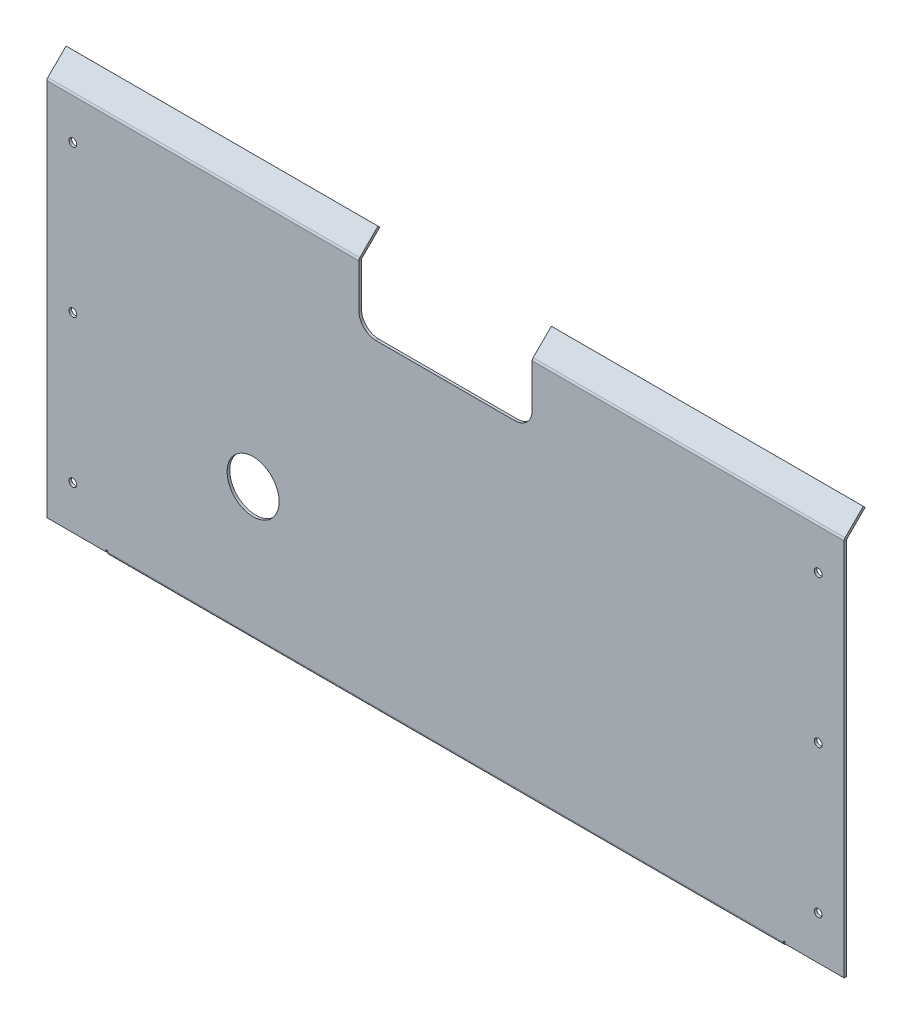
ISO-10303-21;
HEADER;
FILE_DESCRIPTION(('STEP AP214'),'2;1');
FILE_NAME('part.step','',(''),(''),'','','');
FILE_SCHEMA(('AUTOMOTIVE_DESIGN { 1 0 10303 214 1 1 1 1 }'));
ENDSEC;
DATA;
#1=APPLICATION_CONTEXT('core data for automotive mechanical design processes');
#2=APPLICATION_PROTOCOL_DEFINITION('international standard','automotive_design',2000,#1);
#3=PRODUCT_CONTEXT('',#1,'mechanical');
#4=PRODUCT('Part','Part','',(#3));
#5=PRODUCT_RELATED_PRODUCT_CATEGORY('part','',(#4));
#6=PRODUCT_DEFINITION_FORMATION('','',#4);
#7=PRODUCT_DEFINITION_CONTEXT('part definition',#1,'design');
#8=PRODUCT_DEFINITION('design','',#6,#7);
#9=PRODUCT_DEFINITION_SHAPE('','',#8);
#10=(LENGTH_UNIT() NAMED_UNIT(*) SI_UNIT(.MILLI.,.METRE.));
#11=(NAMED_UNIT(*) PLANE_ANGLE_UNIT() SI_UNIT($,.RADIAN.));
#12=(NAMED_UNIT(*) SI_UNIT($,.STERADIAN.) SOLID_ANGLE_UNIT());
#13=UNCERTAINTY_MEASURE_WITH_UNIT(LENGTH_MEASURE(1.E-05),#10,'distance_accuracy_value','');
#14=(GEOMETRIC_REPRESENTATION_CONTEXT(3) GLOBAL_UNCERTAINTY_ASSIGNED_CONTEXT((#13)) GLOBAL_UNIT_ASSIGNED_CONTEXT((#10,
#11,#12)) REPRESENTATION_CONTEXT('',''));
#15=CARTESIAN_POINT('',(0.,0.,0.));
#16=DIRECTION('',(0.,0.,1.));
#17=DIRECTION('',(1.,0.,0.));
#18=AXIS2_PLACEMENT_3D('',#15,#16,#17);
#19=CARTESIAN_POINT('',(80.,20.,3.));
#20=DIRECTION('',(0.,0.,1.));
#21=DIRECTION('',(1.,0.,0.));
#22=AXIS2_PLACEMENT_3D('',#19,#20,#21);
#23=PLANE('',#22);
#24=CARTESIAN_POINT('',(-222.,-217.,3.));
#25=DIRECTION('',(0.,0.,1.));
#26=DIRECTION('',(1.,0.,0.));
#27=AXIS2_PLACEMENT_3D('',#24,#25,#26);
#28=CIRCLE('',#27,30.);
#29=CARTESIAN_POINT('',(-192.,-217.,3.));
#30=VERTEX_POINT('',#29);
#31=EDGE_CURVE('E710',#30,#30,#28,.T.);
#32=ORIENTED_EDGE('',*,*,#31,.F.);
#33=EDGE_LOOP('',(#32));
#34=FACE_BOUND('',#33,.T.);
#35=CARTESIAN_POINT('',(-430.,-147.,3.));
#36=DIRECTION('',(0.,0.,1.));
#37=DIRECTION('',(1.,0.,0.));
#38=AXIS2_PLACEMENT_3D('',#35,#36,#37);
#39=CIRCLE('',#38,4.50000000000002);
#40=CARTESIAN_POINT('',(-425.5,-147.,3.));
#41=VERTEX_POINT('',#40);
#42=EDGE_CURVE('E726',#41,#41,#39,.F.);
#43=ORIENTED_EDGE('',*,*,#42,.T.);
#44=EDGE_LOOP('',(#43));
#45=FACE_BOUND('',#44,.T.);
#46=DIRECTION('',(1.,0.,0.));
#47=VECTOR('',#46,1.);
#48=CARTESIAN_POINT('',(-460.,-367.,3.));
#49=LINE('',#48,#47);
#50=CARTESIAN_POINT('',(-460.,-367.,3.));
#51=VERTEX_POINT('',#50);
#52=CARTESIAN_POINT('',(-391.5,-367.,3.));
#53=VERTEX_POINT('',#52);
#54=EDGE_CURVE('E474',#51,#53,#49,.T.);
#55=ORIENTED_EDGE('',*,*,#54,.T.);
#56=DIRECTION('',(0.,1.,0.));
#57=VECTOR('',#56,1.);
#58=CARTESIAN_POINT('',(-391.5,20.,3.));
#59=LINE('',#58,#57);
#60=CARTESIAN_POINT('',(-391.5,-364.7634,3.));
#61=VERTEX_POINT('',#60);
#62=EDGE_CURVE('E58',#53,#61,#59,.T.);
#63=ORIENTED_EDGE('',*,*,#62,.T.);
#64=DIRECTION('',(1.,0.,0.));
#65=VECTOR('',#64,1.);
#66=CARTESIAN_POINT('',(80.,-364.7634,3.));
#67=LINE('',#66,#65);
#68=CARTESIAN_POINT('',(-390.,-364.7634,3.));
#69=VERTEX_POINT('',#68);
#70=EDGE_CURVE('E62',#61,#69,#67,.T.);
#71=ORIENTED_EDGE('',*,*,#70,.T.);
#72=DIRECTION('',(0.,-1.,0.));
#73=VECTOR('',#72,1.);
#74=CARTESIAN_POINT('',(-390.,20.,3.));
#75=LINE('',#74,#73);
#76=CARTESIAN_POINT('',(-390.,-366.2634,3.));
#77=VERTEX_POINT('',#76);
#78=EDGE_CURVE('E341',#69,#77,#75,.T.);
#79=ORIENTED_EDGE('',*,*,#78,.T.);
#80=DIRECTION('',(-1.,0.,0.));
#81=VECTOR('',#80,1.);
#82=CARTESIAN_POINT('',(-390.,-366.2634,3.));
#83=LINE('',#82,#81);
#84=CARTESIAN_POINT('',(390.,-366.2634,3.));
#85=VERTEX_POINT('',#84);
#86=EDGE_CURVE('E284',#77,#85,#83,.F.);
#87=ORIENTED_EDGE('',*,*,#86,.T.);
#88=DIRECTION('',(0.,1.,0.));
#89=VECTOR('',#88,1.);
#90=CARTESIAN_POINT('',(390.,20.,3.));
#91=LINE('',#90,#89);
#92=CARTESIAN_POINT('',(390.,-364.7634,3.));
#93=VERTEX_POINT('',#92);
#94=EDGE_CURVE('E339',#85,#93,#91,.T.);
#95=ORIENTED_EDGE('',*,*,#94,.T.);
#96=DIRECTION('',(1.,0.,0.));
#97=VECTOR('',#96,1.);
#98=CARTESIAN_POINT('',(80.,-364.7634,3.));
#99=LINE('',#98,#97);
#100=CARTESIAN_POINT('',(391.5,-364.7634,3.));
#101=VERTEX_POINT('',#100);
#102=EDGE_CURVE('E337',#93,#101,#99,.T.);
#103=ORIENTED_EDGE('',*,*,#102,.T.);
#104=DIRECTION('',(0.,-1.,0.));
#105=VECTOR('',#104,1.);
#106=CARTESIAN_POINT('',(391.50000000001,19.9999999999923,3.));
#107=LINE('',#106,#105);
#108=CARTESIAN_POINT('',(391.5,-367.,3.));
#109=VERTEX_POINT('',#108);
#110=EDGE_CURVE('E302',#101,#109,#107,.T.);
#111=ORIENTED_EDGE('',*,*,#110,.T.);
#112=CARTESIAN_POINT('',(460.,-367.,3.));
#113=VERTEX_POINT('',#112);
#114=EDGE_CURVE('E473',#109,#113,#49,.T.);
#115=ORIENTED_EDGE('',*,*,#114,.T.);
#116=DIRECTION('',(0.,1.,0.));
#117=VECTOR('',#116,1.);
#118=CARTESIAN_POINT('',(460.,70.,3.));
#119=LINE('',#118,#117);
#120=CARTESIAN_POINT('',(460.,69.694890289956,3.00000000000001));
#121=VERTEX_POINT('',#120);
#122=EDGE_CURVE('E476',#113,#121,#119,.T.);
#123=ORIENTED_EDGE('',*,*,#122,.T.);
#124=DIRECTION('',(1.,0.,0.));
#125=VECTOR('',#124,1.);
#126=CARTESIAN_POINT('',(460.,69.694890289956,3.00000000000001));
#127=LINE('',#126,#125);
#128=CARTESIAN_POINT('',(100.,69.694890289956,3.));
#129=VERTEX_POINT('',#128);
#130=EDGE_CURVE('E384',#121,#129,#127,.F.);
#131=ORIENTED_EDGE('',*,*,#130,.T.);
#132=DIRECTION('',(0.,-1.,0.));
#133=VECTOR('',#132,1.);
#134=CARTESIAN_POINT('',(100.,20.0000000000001,3.));
#135=LINE('',#134,#133);
#136=CARTESIAN_POINT('',(100.,20.0000000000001,3.));
#137=VERTEX_POINT('',#136);
#138=EDGE_CURVE('E479',#129,#137,#135,.T.);
#139=ORIENTED_EDGE('',*,*,#138,.T.);
#140=CARTESIAN_POINT('',(80.,20.,3.));
#141=DIRECTION('',(0.,0.,-1.));
#142=DIRECTION('',(1.,0.,0.));
#143=AXIS2_PLACEMENT_3D('',#140,#141,#142);
#144=CIRCLE('',#143,20.);
#145=CARTESIAN_POINT('',(79.9999999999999,0.,3.));
#146=VERTEX_POINT('',#145);
#147=EDGE_CURVE('E481',#137,#146,#144,.T.);
#148=ORIENTED_EDGE('',*,*,#147,.T.);
#149=DIRECTION('',(-1.,0.,0.));
#150=VECTOR('',#149,1.);
#151=CARTESIAN_POINT('',(-79.9999999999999,0.,3.));
#152=LINE('',#151,#150);
#153=CARTESIAN_POINT('',(-79.9999999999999,0.,3.));
#154=VERTEX_POINT('',#153);
#155=EDGE_CURVE('E483',#146,#154,#152,.T.);
#156=ORIENTED_EDGE('',*,*,#155,.T.);
#157=CARTESIAN_POINT('',(-80.,20.,3.));
#158=DIRECTION('',(0.,0.,-1.));
#159=DIRECTION('',(1.,0.,0.));
#160=AXIS2_PLACEMENT_3D('',#157,#158,#159);
#161=CIRCLE('',#160,20.);
#162=CARTESIAN_POINT('',(-100.,20.0000000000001,3.));
#163=VERTEX_POINT('',#162);
#164=EDGE_CURVE('E485',#154,#163,#161,.T.);
#165=ORIENTED_EDGE('',*,*,#164,.T.);
#166=DIRECTION('',(0.,1.,0.));
#167=VECTOR('',#166,1.);
#168=CARTESIAN_POINT('',(-100.,70.,3.));
#169=LINE('',#168,#167);
#170=CARTESIAN_POINT('',(-100.,69.694890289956,3.00000000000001));
#171=VERTEX_POINT('',#170);
#172=EDGE_CURVE('E487',#163,#171,#169,.T.);
#173=ORIENTED_EDGE('',*,*,#172,.T.);
#174=DIRECTION('',(1.,0.,0.));
#175=VECTOR('',#174,1.);
#176=CARTESIAN_POINT('',(-99.9999999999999,69.694890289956,3.00000000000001));
#177=LINE('',#176,#175);
#178=CARTESIAN_POINT('',(-460.,69.694890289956,3.));
#179=VERTEX_POINT('',#178);
#180=EDGE_CURVE('E437',#171,#179,#177,.F.);
#181=ORIENTED_EDGE('',*,*,#180,.T.);
#182=DIRECTION('',(0.,-1.,0.));
#183=VECTOR('',#182,1.);
#184=CARTESIAN_POINT('',(-460.,70.,3.));
#185=LINE('',#184,#183);
#186=EDGE_CURVE('E471',#179,#51,#185,.T.);
#187=ORIENTED_EDGE('',*,*,#186,.T.);
#188=EDGE_LOOP('',(#55,#63,#71,#79,#87,#95,#103,#111,#115,#123,#131,#139,#148,#156,#165,#173,
#181,#187));
#189=FACE_BOUND('',#188,.T.);
#190=CARTESIAN_POINT('',(430.,23.,3.));
#191=DIRECTION('',(0.,0.,1.));
#192=DIRECTION('',(1.,0.,0.));
#193=AXIS2_PLACEMENT_3D('',#190,#191,#192);
#194=CIRCLE('',#193,4.50000000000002);
#195=CARTESIAN_POINT('',(434.5,23.,3.));
#196=VERTEX_POINT('',#195);
#197=EDGE_CURVE('E640',#196,#196,#194,.T.);
#198=ORIENTED_EDGE('',*,*,#197,.F.);
#199=EDGE_LOOP('',(#198));
#200=FACE_BOUND('',#199,.T.);
#201=CARTESIAN_POINT('',(430.,-147.,3.));
#202=DIRECTION('',(0.,0.,1.));
#203=DIRECTION('',(1.,0.,0.));
#204=AXIS2_PLACEMENT_3D('',#201,#202,#203);
#205=CIRCLE('',#204,4.50000000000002);
#206=CARTESIAN_POINT('',(434.5,-147.,3.));
#207=VERTEX_POINT('',#206);
#208=EDGE_CURVE('E744',#207,#207,#205,.T.);
#209=ORIENTED_EDGE('',*,*,#208,.F.);
#210=EDGE_LOOP('',(#209));
#211=FACE_BOUND('',#210,.T.);
#212=CARTESIAN_POINT('',(430.,-317.,3.));
#213=DIRECTION('',(0.,0.,1.));
#214=DIRECTION('',(1.,0.,0.));
#215=AXIS2_PLACEMENT_3D('',#212,#213,#214);
#216=CIRCLE('',#215,4.50000000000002);
#217=CARTESIAN_POINT('',(434.5,-317.,3.));
#218=VERTEX_POINT('',#217);
#219=EDGE_CURVE('E738',#218,#218,#216,.T.);
#220=ORIENTED_EDGE('',*,*,#219,.F.);
#221=EDGE_LOOP('',(#220));
#222=FACE_BOUND('',#221,.T.);
#223=CARTESIAN_POINT('',(-430.,23.,3.));
#224=DIRECTION('',(0.,0.,1.));
#225=DIRECTION('',(1.,0.,0.));
#226=AXIS2_PLACEMENT_3D('',#223,#224,#225);
#227=CIRCLE('',#226,4.50000000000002);
#228=CARTESIAN_POINT('',(-425.5,23.,3.));
#229=VERTEX_POINT('',#228);
#230=EDGE_CURVE('E732',#229,#229,#227,.F.);
#231=ORIENTED_EDGE('',*,*,#230,.T.);
#232=EDGE_LOOP('',(#231));
#233=FACE_BOUND('',#232,.T.);
#234=CARTESIAN_POINT('',(-430.,-317.,3.));
#235=DIRECTION('',(0.,0.,1.));
#236=DIRECTION('',(1.,0.,0.));
#237=AXIS2_PLACEMENT_3D('',#234,#235,#236);
#238=CIRCLE('',#237,4.50000000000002);
#239=CARTESIAN_POINT('',(-425.5,-317.,3.));
#240=VERTEX_POINT('',#239);
#241=EDGE_CURVE('E720',#240,#240,#238,.F.);
#242=ORIENTED_EDGE('',*,*,#241,.T.);
#243=EDGE_LOOP('',(#242));
#244=FACE_BOUND('',#243,.T.);
#245=ADVANCED_FACE('F43',(#34,#45,#189,#200,#211,#222,#233,#244),#23,.T.);
#246=CARTESIAN_POINT('',(80.,20.,0.));
#247=DIRECTION('',(0.,0.,1.));
#248=DIRECTION('',(1.,0.,0.));
#249=AXIS2_PLACEMENT_3D('',#246,#247,#248);
#250=PLANE('',#249);
#251=CARTESIAN_POINT('',(-222.,-217.,0.));
#252=DIRECTION('',(0.,0.,-1.));
#253=DIRECTION('',(-1.,0.,0.));
#254=AXIS2_PLACEMENT_3D('',#251,#252,#253);
#255=CIRCLE('',#254,30.);
#256=CARTESIAN_POINT('',(-252.,-217.,0.));
#257=VERTEX_POINT('',#256);
#258=EDGE_CURVE('E713',#257,#257,#255,.T.);
#259=ORIENTED_EDGE('',*,*,#258,.F.);
#260=EDGE_LOOP('',(#259));
#261=FACE_BOUND('',#260,.T.);
#262=CARTESIAN_POINT('',(-430.,-147.,0.));
#263=DIRECTION('',(0.,0.,1.));
#264=DIRECTION('',(1.,0.,0.));
#265=AXIS2_PLACEMENT_3D('',#262,#263,#264);
#266=CIRCLE('',#265,4.50000000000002);
#267=CARTESIAN_POINT('',(-425.5,-147.,0.));
#268=VERTEX_POINT('',#267);
#269=EDGE_CURVE('E723',#268,#268,#266,.T.);
#270=ORIENTED_EDGE('',*,*,#269,.T.);
#271=EDGE_LOOP('',(#270));
#272=FACE_BOUND('',#271,.T.);
#273=DIRECTION('',(0.,1.,0.));
#274=VECTOR('',#273,1.);
#275=CARTESIAN_POINT('',(-391.5,-367.,0.));
#276=LINE('',#275,#274);
#277=CARTESIAN_POINT('',(-391.5,-367.,0.));
#278=VERTEX_POINT('',#277);
#279=CARTESIAN_POINT('',(-391.5,-364.7634,0.));
#280=VERTEX_POINT('',#279);
#281=EDGE_CURVE('E299',#278,#280,#276,.T.);
#282=ORIENTED_EDGE('',*,*,#281,.F.);
#283=DIRECTION('',(1.,0.,0.));
#284=VECTOR('',#283,1.);
#285=CARTESIAN_POINT('',(-460.,-367.,0.));
#286=LINE('',#285,#284);
#287=CARTESIAN_POINT('',(-460.,-367.,0.));
#288=VERTEX_POINT('',#287);
#289=EDGE_CURVE('E454',#288,#278,#286,.T.);
#290=ORIENTED_EDGE('',*,*,#289,.F.);
#291=DIRECTION('',(0.,-1.,0.));
#292=VECTOR('',#291,1.);
#293=CARTESIAN_POINT('',(-460.,70.,0.));
#294=LINE('',#293,#292);
#295=CARTESIAN_POINT('',(-460.,69.694890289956,0.));
#296=VERTEX_POINT('',#295);
#297=EDGE_CURVE('E449',#296,#288,#294,.T.);
#298=ORIENTED_EDGE('',*,*,#297,.F.);
#299=DIRECTION('',(1.,0.,0.));
#300=VECTOR('',#299,1.);
#301=CARTESIAN_POINT('',(-99.9999999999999,69.694890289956,0.));
#302=LINE('',#301,#300);
#303=CARTESIAN_POINT('',(-100.,69.694890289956,0.));
#304=VERTEX_POINT('',#303);
#305=EDGE_CURVE('E433',#304,#296,#302,.F.);
#306=ORIENTED_EDGE('',*,*,#305,.F.);
#307=DIRECTION('',(0.,1.,0.));
#308=VECTOR('',#307,1.);
#309=CARTESIAN_POINT('',(-100.,70.,0.));
#310=LINE('',#309,#308);
#311=CARTESIAN_POINT('',(-100.,20.0000000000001,0.));
#312=VERTEX_POINT('',#311);
#313=EDGE_CURVE('E468',#312,#304,#310,.T.);
#314=ORIENTED_EDGE('',*,*,#313,.F.);
#315=CARTESIAN_POINT('',(-80.,20.,0.));
#316=DIRECTION('',(0.,0.,-1.));
#317=DIRECTION('',(1.,0.,0.));
#318=AXIS2_PLACEMENT_3D('',#315,#316,#317);
#319=CIRCLE('',#318,20.);
#320=CARTESIAN_POINT('',(-79.9999999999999,0.,0.));
#321=VERTEX_POINT('',#320);
#322=EDGE_CURVE('E466',#321,#312,#319,.T.);
#323=ORIENTED_EDGE('',*,*,#322,.F.);
#324=DIRECTION('',(-1.,0.,0.));
#325=VECTOR('',#324,1.);
#326=CARTESIAN_POINT('',(-79.9999999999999,0.,0.));
#327=LINE('',#326,#325);
#328=CARTESIAN_POINT('',(79.9999999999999,0.,0.));
#329=VERTEX_POINT('',#328);
#330=EDGE_CURVE('E464',#329,#321,#327,.T.);
#331=ORIENTED_EDGE('',*,*,#330,.F.);
#332=CARTESIAN_POINT('',(80.,20.,0.));
#333=DIRECTION('',(0.,0.,-1.));
#334=DIRECTION('',(1.,0.,0.));
#335=AXIS2_PLACEMENT_3D('',#332,#333,#334);
#336=CIRCLE('',#335,20.);
#337=CARTESIAN_POINT('',(100.,20.0000000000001,0.));
#338=VERTEX_POINT('',#337);
#339=EDGE_CURVE('E462',#338,#329,#336,.T.);
#340=ORIENTED_EDGE('',*,*,#339,.F.);
#341=DIRECTION('',(0.,-1.,0.));
#342=VECTOR('',#341,1.);
#343=CARTESIAN_POINT('',(100.,20.0000000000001,0.));
#344=LINE('',#343,#342);
#345=CARTESIAN_POINT('',(100.,69.694890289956,0.));
#346=VERTEX_POINT('',#345);
#347=EDGE_CURVE('E460',#346,#338,#344,.T.);
#348=ORIENTED_EDGE('',*,*,#347,.F.);
#349=DIRECTION('',(1.,0.,0.));
#350=VECTOR('',#349,1.);
#351=CARTESIAN_POINT('',(460.,69.694890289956,0.));
#352=LINE('',#351,#350);
#353=CARTESIAN_POINT('',(460.,69.694890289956,0.));
#354=VERTEX_POINT('',#353);
#355=EDGE_CURVE('E380',#354,#346,#352,.F.);
#356=ORIENTED_EDGE('',*,*,#355,.F.);
#357=DIRECTION('',(0.,1.,0.));
#358=VECTOR('',#357,1.);
#359=CARTESIAN_POINT('',(460.,70.,0.));
#360=LINE('',#359,#358);
#361=CARTESIAN_POINT('',(460.,-367.,0.));
#362=VERTEX_POINT('',#361);
#363=EDGE_CURVE('E457',#362,#354,#360,.T.);
#364=ORIENTED_EDGE('',*,*,#363,.F.);
#365=CARTESIAN_POINT('',(391.5,-367.,0.));
#366=VERTEX_POINT('',#365);
#367=EDGE_CURVE('E453',#366,#362,#286,.T.);
#368=ORIENTED_EDGE('',*,*,#367,.F.);
#369=DIRECTION('',(0.,-1.,0.));
#370=VECTOR('',#369,1.);
#371=CARTESIAN_POINT('',(391.5,-364.7634,0.));
#372=LINE('',#371,#370);
#373=CARTESIAN_POINT('',(391.5,-364.7634,0.));
#374=VERTEX_POINT('',#373);
#375=EDGE_CURVE('E319',#374,#366,#372,.T.);
#376=ORIENTED_EDGE('',*,*,#375,.F.);
#377=DIRECTION('',(1.,0.,0.));
#378=VECTOR('',#377,1.);
#379=CARTESIAN_POINT('',(390.,-364.7634,0.));
#380=LINE('',#379,#378);
#381=CARTESIAN_POINT('',(390.,-364.7634,0.));
#382=VERTEX_POINT('',#381);
#383=EDGE_CURVE('E315',#382,#374,#380,.T.);
#384=ORIENTED_EDGE('',*,*,#383,.F.);
#385=DIRECTION('',(0.,1.,0.));
#386=VECTOR('',#385,1.);
#387=CARTESIAN_POINT('',(390.,-366.2634,0.));
#388=LINE('',#387,#386);
#389=CARTESIAN_POINT('',(390.,-366.2634,0.));
#390=VERTEX_POINT('',#389);
#391=EDGE_CURVE('E312',#390,#382,#388,.T.);
#392=ORIENTED_EDGE('',*,*,#391,.F.);
#393=DIRECTION('',(-1.,0.,0.));
#394=VECTOR('',#393,1.);
#395=CARTESIAN_POINT('',(-390.,-366.2634,0.));
#396=LINE('',#395,#394);
#397=CARTESIAN_POINT('',(-390.,-366.2634,0.));
#398=VERTEX_POINT('',#397);
#399=EDGE_CURVE('E280',#398,#390,#396,.F.);
#400=ORIENTED_EDGE('',*,*,#399,.F.);
#401=DIRECTION('',(0.,-1.,0.));
#402=VECTOR('',#401,1.);
#403=CARTESIAN_POINT('',(-390.,-364.7634,0.));
#404=LINE('',#403,#402);
#405=CARTESIAN_POINT('',(-390.,-364.7634,0.));
#406=VERTEX_POINT('',#405);
#407=EDGE_CURVE('E308',#406,#398,#404,.T.);
#408=ORIENTED_EDGE('',*,*,#407,.F.);
#409=DIRECTION('',(1.,0.,0.));
#410=VECTOR('',#409,1.);
#411=CARTESIAN_POINT('',(-391.5,-364.7634,0.));
#412=LINE('',#411,#410);
#413=EDGE_CURVE('E304',#280,#406,#412,.T.);
#414=ORIENTED_EDGE('',*,*,#413,.F.);
#415=EDGE_LOOP('',(#282,#290,#298,#306,#314,#323,#331,#340,#348,#356,#364,#368,#376,#384,#392,
#400,#408,#414));
#416=FACE_BOUND('',#415,.T.);
#417=CARTESIAN_POINT('',(430.,23.,0.));
#418=DIRECTION('',(0.,0.,-1.));
#419=DIRECTION('',(-1.,0.,0.));
#420=AXIS2_PLACEMENT_3D('',#417,#418,#419);
#421=CIRCLE('',#420,4.50000000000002);
#422=CARTESIAN_POINT('',(425.5,23.,0.));
#423=VERTEX_POINT('',#422);
#424=EDGE_CURVE('E644',#423,#423,#421,.T.);
#425=ORIENTED_EDGE('',*,*,#424,.F.);
#426=EDGE_LOOP('',(#425));
#427=FACE_BOUND('',#426,.T.);
#428=CARTESIAN_POINT('',(430.,-147.,0.));
#429=DIRECTION('',(0.,0.,-1.));
#430=DIRECTION('',(-1.,0.,0.));
#431=AXIS2_PLACEMENT_3D('',#428,#429,#430);
#432=CIRCLE('',#431,4.50000000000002);
#433=CARTESIAN_POINT('',(425.5,-147.,0.));
#434=VERTEX_POINT('',#433);
#435=EDGE_CURVE('E741',#434,#434,#432,.T.);
#436=ORIENTED_EDGE('',*,*,#435,.F.);
#437=EDGE_LOOP('',(#436));
#438=FACE_BOUND('',#437,.T.);
#439=CARTESIAN_POINT('',(430.,-317.,0.));
#440=DIRECTION('',(0.,0.,-1.));
#441=DIRECTION('',(-1.,0.,0.));
#442=AXIS2_PLACEMENT_3D('',#439,#440,#441);
#443=CIRCLE('',#442,4.50000000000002);
#444=CARTESIAN_POINT('',(425.5,-317.,0.));
#445=VERTEX_POINT('',#444);
#446=EDGE_CURVE('E735',#445,#445,#443,.T.);
#447=ORIENTED_EDGE('',*,*,#446,.F.);
#448=EDGE_LOOP('',(#447));
#449=FACE_BOUND('',#448,.T.);
#450=CARTESIAN_POINT('',(-430.,23.,0.));
#451=DIRECTION('',(0.,0.,1.));
#452=DIRECTION('',(1.,0.,0.));
#453=AXIS2_PLACEMENT_3D('',#450,#451,#452);
#454=CIRCLE('',#453,4.50000000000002);
#455=CARTESIAN_POINT('',(-425.5,23.,0.));
#456=VERTEX_POINT('',#455);
#457=EDGE_CURVE('E729',#456,#456,#454,.T.);
#458=ORIENTED_EDGE('',*,*,#457,.T.);
#459=EDGE_LOOP('',(#458));
#460=FACE_BOUND('',#459,.T.);
#461=CARTESIAN_POINT('',(-430.,-317.,0.));
#462=DIRECTION('',(0.,0.,1.));
#463=DIRECTION('',(1.,0.,0.));
#464=AXIS2_PLACEMENT_3D('',#461,#462,#463);
#465=CIRCLE('',#464,4.50000000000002);
#466=CARTESIAN_POINT('',(-425.5,-317.,0.));
#467=VERTEX_POINT('',#466);
#468=EDGE_CURVE('E715',#467,#467,#465,.T.);
#469=ORIENTED_EDGE('',*,*,#468,.T.);
#470=EDGE_LOOP('',(#469));
#471=FACE_BOUND('',#470,.T.);
#472=ADVANCED_FACE('F511',(#261,#272,#416,#427,#438,#449,#460,#471),#250,.F.);
#473=CARTESIAN_POINT('',(-460.,-367.,3.));
#474=DIRECTION('',(0.,1.,0.));
#475=DIRECTION('',(0.,0.,1.));
#476=AXIS2_PLACEMENT_3D('',#473,#474,#475);
#477=PLANE('',#476);
#478=DIRECTION('',(0.,0.,1.));
#479=VECTOR('',#478,1.);
#480=CARTESIAN_POINT('',(-391.5,-367.,0.));
#481=LINE('',#480,#479);
#482=EDGE_CURVE('E303',#278,#53,#481,.T.);
#483=ORIENTED_EDGE('',*,*,#482,.T.);
#484=ORIENTED_EDGE('',*,*,#54,.F.);
#485=DIRECTION('',(0.,0.,-1.));
#486=VECTOR('',#485,1.);
#487=CARTESIAN_POINT('',(-460.,-367.,3.));
#488=LINE('',#487,#486);
#489=EDGE_CURVE('E11',#51,#288,#488,.T.);
#490=ORIENTED_EDGE('',*,*,#489,.T.);
#491=ORIENTED_EDGE('',*,*,#289,.T.);
#492=EDGE_LOOP('',(#483,#484,#490,#491));
#493=FACE_BOUND('',#492,.T.);
#494=ADVANCED_FACE('F570',(#493),#477,.F.);
#495=DIRECTION('',(0.,0.,1.));
#496=VECTOR('',#495,1.);
#497=CARTESIAN_POINT('',(391.5,-367.,0.));
#498=LINE('',#497,#496);
#499=EDGE_CURVE('E322',#366,#109,#498,.T.);
#500=ORIENTED_EDGE('',*,*,#499,.F.);
#501=ORIENTED_EDGE('',*,*,#367,.T.);
#502=DIRECTION('',(0.,0.,-1.));
#503=VECTOR('',#502,1.);
#504=CARTESIAN_POINT('',(460.,-367.,3.));
#505=LINE('',#504,#503);
#506=EDGE_CURVE('E51',#113,#362,#505,.T.);
#507=ORIENTED_EDGE('',*,*,#506,.F.);
#508=ORIENTED_EDGE('',*,*,#114,.F.);
#509=EDGE_LOOP('',(#500,#501,#507,#508));
#510=FACE_BOUND('',#509,.T.);
#511=ADVANCED_FACE('F597',(#510),#477,.F.);
#512=CARTESIAN_POINT('',(460.,70.,3.));
#513=DIRECTION('',(-1.,0.,0.));
#514=DIRECTION('',(0.,-1.,0.));
#515=AXIS2_PLACEMENT_3D('',#512,#513,#514);
#516=PLANE('',#515);
#517=DIRECTION('',(0.,0.,1.));
#518=VECTOR('',#517,1.);
#519=CARTESIAN_POINT('',(460.,69.694890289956,0.));
#520=LINE('',#519,#518);
#521=EDGE_CURVE('E390',#354,#121,#520,.T.);
#522=ORIENTED_EDGE('',*,*,#521,.T.);
#523=ORIENTED_EDGE('',*,*,#122,.F.);
#524=ORIENTED_EDGE('',*,*,#506,.T.);
#525=ORIENTED_EDGE('',*,*,#363,.T.);
#526=EDGE_LOOP('',(#522,#523,#524,#525));
#527=FACE_BOUND('',#526,.T.);
#528=ADVANCED_FACE('F506',(#527),#516,.F.);
#529=CARTESIAN_POINT('',(100.,20.0000000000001,3.));
#530=DIRECTION('',(1.,0.,0.));
#531=DIRECTION('',(0.,0.,-1.));
#532=AXIS2_PLACEMENT_3D('',#529,#530,#531);
#533=PLANE('',#532);
#534=DIRECTION('',(0.,0.,1.));
#535=VECTOR('',#534,1.);
#536=CARTESIAN_POINT('',(100.,69.694890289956,0.));
#537=LINE('',#536,#535);
#538=EDGE_CURVE('E393',#346,#129,#537,.T.);
#539=ORIENTED_EDGE('',*,*,#538,.F.);
#540=ORIENTED_EDGE('',*,*,#347,.T.);
#541=DIRECTION('',(0.,0.,-1.));
#542=VECTOR('',#541,1.);
#543=CARTESIAN_POINT('',(100.,20.0000000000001,3.));
#544=LINE('',#543,#542);
#545=EDGE_CURVE('E499',#137,#338,#544,.T.);
#546=ORIENTED_EDGE('',*,*,#545,.F.);
#547=ORIENTED_EDGE('',*,*,#138,.F.);
#548=EDGE_LOOP('',(#539,#540,#546,#547));
#549=FACE_BOUND('',#548,.T.);
#550=ADVANCED_FACE('F525',(#549),#533,.F.);
#551=CARTESIAN_POINT('',(-460.,70.,3.));
#552=DIRECTION('',(1.,0.,0.));
#553=DIRECTION('',(0.,1.,0.));
#554=AXIS2_PLACEMENT_3D('',#551,#552,#553);
#555=PLANE('',#554);
#556=DIRECTION('',(0.,0.,1.));
#557=VECTOR('',#556,1.);
#558=CARTESIAN_POINT('',(-460.,69.694890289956,0.));
#559=LINE('',#558,#557);
#560=EDGE_CURVE('E446',#296,#179,#559,.T.);
#561=ORIENTED_EDGE('',*,*,#560,.F.);
#562=ORIENTED_EDGE('',*,*,#297,.T.);
#563=ORIENTED_EDGE('',*,*,#489,.F.);
#564=ORIENTED_EDGE('',*,*,#186,.F.);
#565=EDGE_LOOP('',(#561,#562,#563,#564));
#566=FACE_BOUND('',#565,.T.);
#567=ADVANCED_FACE('F45',(#566),#555,.F.);
#568=CARTESIAN_POINT('',(-100.,70.,3.));
#569=DIRECTION('',(-1.,0.,0.));
#570=DIRECTION('',(0.,-1.,0.));
#571=AXIS2_PLACEMENT_3D('',#568,#569,#570);
#572=PLANE('',#571);
#573=DIRECTION('',(0.,0.,1.));
#574=VECTOR('',#573,1.);
#575=CARTESIAN_POINT('',(-100.,69.694890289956,0.));
#576=LINE('',#575,#574);
#577=EDGE_CURVE('E443',#304,#171,#576,.T.);
#578=ORIENTED_EDGE('',*,*,#577,.T.);
#579=ORIENTED_EDGE('',*,*,#172,.F.);
#580=DIRECTION('',(0.,0.,-1.));
#581=VECTOR('',#580,1.);
#582=CARTESIAN_POINT('',(-100.,20.0000000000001,3.));
#583=LINE('',#582,#581);
#584=EDGE_CURVE('E490',#163,#312,#583,.T.);
#585=ORIENTED_EDGE('',*,*,#584,.T.);
#586=ORIENTED_EDGE('',*,*,#313,.T.);
#587=EDGE_LOOP('',(#578,#579,#585,#586));
#588=FACE_BOUND('',#587,.T.);
#589=ADVANCED_FACE('F577',(#588),#572,.F.);
#590=CARTESIAN_POINT('',(80.,20.,3.));
#591=DIRECTION('',(0.,0.,-1.));
#592=DIRECTION('',(-1.,0.,0.));
#593=AXIS2_PLACEMENT_3D('',#590,#591,#592);
#594=CYLINDRICAL_SURFACE('',#593,20.);
#595=ORIENTED_EDGE('',*,*,#339,.T.);
#596=DIRECTION('',(0.,0.,-1.));
#597=VECTOR('',#596,1.);
#598=CARTESIAN_POINT('',(79.9999999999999,0.,3.));
#599=LINE('',#598,#597);
#600=EDGE_CURVE('E496',#146,#329,#599,.T.);
#601=ORIENTED_EDGE('',*,*,#600,.F.);
#602=ORIENTED_EDGE('',*,*,#147,.F.);
#603=ORIENTED_EDGE('',*,*,#545,.T.);
#604=EDGE_LOOP('',(#595,#601,#602,#603));
#605=FACE_BOUND('',#604,.T.);
#606=ADVANCED_FACE('F580',(#605),#594,.F.);
#607=CARTESIAN_POINT('',(-79.9999999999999,0.,3.));
#608=DIRECTION('',(0.,-1.,0.));
#609=DIRECTION('',(1.,0.,0.));
#610=AXIS2_PLACEMENT_3D('',#607,#608,#609);
#611=PLANE('',#610);
#612=ORIENTED_EDGE('',*,*,#330,.T.);
#613=DIRECTION('',(0.,0.,-1.));
#614=VECTOR('',#613,1.);
#615=CARTESIAN_POINT('',(-79.9999999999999,0.,3.));
#616=LINE('',#615,#614);
#617=EDGE_CURVE('E493',#154,#321,#616,.T.);
#618=ORIENTED_EDGE('',*,*,#617,.F.);
#619=ORIENTED_EDGE('',*,*,#155,.F.);
#620=ORIENTED_EDGE('',*,*,#600,.T.);
#621=EDGE_LOOP('',(#612,#618,#619,#620));
#622=FACE_BOUND('',#621,.T.);
#623=ADVANCED_FACE('F586',(#622),#611,.F.);
#624=CARTESIAN_POINT('',(-80.,20.,3.));
#625=DIRECTION('',(0.,0.,-1.));
#626=DIRECTION('',(-1.,0.,0.));
#627=AXIS2_PLACEMENT_3D('',#624,#625,#626);
#628=CYLINDRICAL_SURFACE('',#627,20.);
#629=ORIENTED_EDGE('',*,*,#322,.T.);
#630=ORIENTED_EDGE('',*,*,#584,.F.);
#631=ORIENTED_EDGE('',*,*,#164,.F.);
#632=ORIENTED_EDGE('',*,*,#617,.T.);
#633=EDGE_LOOP('',(#629,#630,#631,#632));
#634=FACE_BOUND('',#633,.T.);
#635=ADVANCED_FACE('F582',(#634),#628,.F.);
#636=CARTESIAN_POINT('',(-460.,69.694890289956,-0.736600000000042));
#637=DIRECTION('',(-1.,0.,0.));
#638=DIRECTION('',(0.,0.,1.));
#639=AXIS2_PLACEMENT_3D('',#636,#637,#638);
#640=PLANE('',#639);
#641=DIRECTION('',(0.,0.707106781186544,0.707106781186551));
#642=VECTOR('',#641,1.);
#643=CARTESIAN_POINT('',(-460.,70.215745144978,-0.215745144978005));
#644=LINE('',#643,#642);
#645=CARTESIAN_POINT('',(-460.,70.215745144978,-0.215745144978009));
#646=VERTEX_POINT('',#645);
#647=CARTESIAN_POINT('',(-460.,72.3370654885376,1.90557519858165));
#648=VERTEX_POINT('',#647);
#649=EDGE_CURVE('E396',#646,#648,#644,.T.);
#650=ORIENTED_EDGE('',*,*,#649,.F.);
#651=CARTESIAN_POINT('',(-460.,69.694890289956,-0.736600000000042));
#652=DIRECTION('',(1.,0.,0.));
#653=DIRECTION('',(0.,0.,-1.));
#654=AXIS2_PLACEMENT_3D('',#651,#652,#653);
#655=CIRCLE('',#654,0.736600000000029);
#656=EDGE_CURVE('E429',#296,#646,#655,.F.);
#657=ORIENTED_EDGE('',*,*,#656,.F.);
#658=ORIENTED_EDGE('',*,*,#560,.T.);
#659=CARTESIAN_POINT('',(-460.,69.694890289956,-0.736600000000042));
#660=DIRECTION('',(1.,0.,0.));
#661=DIRECTION('',(0.,0.,-1.));
#662=AXIS2_PLACEMENT_3D('',#659,#660,#661);
#663=CIRCLE('',#662,3.73660000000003);
#664=EDGE_CURVE('E440',#179,#648,#663,.F.);
#665=ORIENTED_EDGE('',*,*,#664,.T.);
#666=EDGE_LOOP('',(#650,#657,#658,#665));
#667=FACE_BOUND('',#666,.T.);
#668=ADVANCED_FACE('F585',(#667),#640,.T.);
#669=CARTESIAN_POINT('',(-100.,69.694890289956,-0.736600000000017));
#670=DIRECTION('',(-1.,0.,0.));
#671=DIRECTION('',(0.,0.,1.));
#672=AXIS2_PLACEMENT_3D('',#669,#670,#671);
#673=PLANE('',#672);
#674=CARTESIAN_POINT('',(-100.,69.694890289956,-0.736600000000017));
#675=DIRECTION('',(1.,0.,0.));
#676=DIRECTION('',(0.,0.,-1.));
#677=AXIS2_PLACEMENT_3D('',#674,#675,#676);
#678=CIRCLE('',#677,0.736600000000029);
#679=CARTESIAN_POINT('',(-100.,70.215745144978,-0.215745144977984));
#680=VERTEX_POINT('',#679);
#681=EDGE_CURVE('E428',#680,#304,#678,.T.);
#682=ORIENTED_EDGE('',*,*,#681,.F.);
#683=DIRECTION('',(0.,0.707106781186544,0.707106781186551));
#684=VECTOR('',#683,1.);
#685=CARTESIAN_POINT('',(-100.,70.215745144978,-0.215745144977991));
#686=LINE('',#685,#684);
#687=CARTESIAN_POINT('',(-100.,72.3370654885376,1.90557519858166));
#688=VERTEX_POINT('',#687);
#689=EDGE_CURVE('E401',#680,#688,#686,.T.);
#690=ORIENTED_EDGE('',*,*,#689,.T.);
#691=CARTESIAN_POINT('',(-100.,69.694890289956,-0.736600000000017));
#692=DIRECTION('',(1.,0.,0.));
#693=DIRECTION('',(0.,0.,-1.));
#694=AXIS2_PLACEMENT_3D('',#691,#692,#693);
#695=CIRCLE('',#694,3.73660000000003);
#696=EDGE_CURVE('E432',#688,#171,#695,.T.);
#697=ORIENTED_EDGE('',*,*,#696,.T.);
#698=ORIENTED_EDGE('',*,*,#577,.F.);
#699=EDGE_LOOP('',(#682,#690,#697,#698));
#700=FACE_BOUND('',#699,.T.);
#701=ADVANCED_FACE('F1046',(#700),#673,.F.);
#702=CARTESIAN_POINT('',(-99.9999999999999,69.694890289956,-0.736600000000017));
#703=DIRECTION('',(1.,0.,0.));
#704=DIRECTION('',(0.,0.707106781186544,0.707106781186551));
#705=AXIS2_PLACEMENT_3D('',#702,#703,#704);
#706=CYLINDRICAL_SURFACE('',#705,3.73660000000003);
#707=ORIENTED_EDGE('',*,*,#180,.F.);
#708=ORIENTED_EDGE('',*,*,#696,.F.);
#709=DIRECTION('',(-1.,0.,0.));
#710=VECTOR('',#709,1.);
#711=CARTESIAN_POINT('',(-460.,72.3370654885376,1.90557519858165));
#712=LINE('',#711,#710);
#713=EDGE_CURVE('E404',#688,#648,#712,.T.);
#714=ORIENTED_EDGE('',*,*,#713,.T.);
#715=ORIENTED_EDGE('',*,*,#664,.F.);
#716=EDGE_LOOP('',(#707,#708,#714,#715));
#717=FACE_BOUND('',#716,.T.);
#718=ADVANCED_FACE('F1043',(#717),#706,.T.);
#719=CARTESIAN_POINT('',(-99.9999999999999,69.694890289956,-0.736600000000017));
#720=DIRECTION('',(1.,0.,0.));
#721=DIRECTION('',(0.,0.707106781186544,0.707106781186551));
#722=AXIS2_PLACEMENT_3D('',#719,#720,#721);
#723=CYLINDRICAL_SURFACE('',#722,0.736600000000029);
#724=ORIENTED_EDGE('',*,*,#305,.T.);
#725=ORIENTED_EDGE('',*,*,#656,.T.);
#726=DIRECTION('',(1.,0.,0.));
#727=VECTOR('',#726,1.);
#728=CARTESIAN_POINT('',(-460.,70.215745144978,-0.215745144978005));
#729=LINE('',#728,#727);
#730=EDGE_CURVE('E399',#646,#680,#729,.T.);
#731=ORIENTED_EDGE('',*,*,#730,.T.);
#732=ORIENTED_EDGE('',*,*,#681,.T.);
#733=EDGE_LOOP('',(#724,#725,#731,#732));
#734=FACE_BOUND('',#733,.T.);
#735=ADVANCED_FACE('F1033',(#734),#723,.F.);
#736=CARTESIAN_POINT('',(-100.,93.3345237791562,-19.0918830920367));
#737=DIRECTION('',(-1.,0.,0.));
#738=DIRECTION('',(0.,-1.,0.));
#739=AXIS2_PLACEMENT_3D('',#736,#737,#738);
#740=PLANE('',#739);
#741=ORIENTED_EDGE('',*,*,#689,.F.);
#742=DIRECTION('',(0.,0.707106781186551,-0.707106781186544));
#743=VECTOR('',#742,1.);
#744=CARTESIAN_POINT('',(-100.,91.2132034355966,-21.2132034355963));
#745=LINE('',#744,#743);
#746=CARTESIAN_POINT('',(-100.,91.2132034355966,-21.2132034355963));
#747=VERTEX_POINT('',#746);
#748=EDGE_CURVE('E408',#680,#747,#745,.T.);
#749=ORIENTED_EDGE('',*,*,#748,.T.);
#750=DIRECTION('',(0.,-0.707106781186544,-0.707106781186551));
#751=VECTOR('',#750,1.);
#752=CARTESIAN_POINT('',(-100.,93.3345237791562,-19.0918830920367));
#753=LINE('',#752,#751);
#754=CARTESIAN_POINT('',(-100.,93.3345237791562,-19.0918830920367));
#755=VERTEX_POINT('',#754);
#756=EDGE_CURVE('E425',#755,#747,#753,.T.);
#757=ORIENTED_EDGE('',*,*,#756,.F.);
#758=DIRECTION('',(0.,0.707106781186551,-0.707106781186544));
#759=VECTOR('',#758,1.);
#760=CARTESIAN_POINT('',(-100.,93.3345237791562,-19.0918830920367));
#761=LINE('',#760,#759);
#762=EDGE_CURVE('E415',#688,#755,#761,.T.);
#763=ORIENTED_EDGE('',*,*,#762,.F.);
#764=EDGE_LOOP('',(#741,#749,#757,#763));
#765=FACE_BOUND('',#764,.T.);
#766=ADVANCED_FACE('F1023',(#765),#740,.F.);
#767=CARTESIAN_POINT('',(-460.,72.1213203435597,2.12132034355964));
#768=DIRECTION('',(1.,0.,0.));
#769=DIRECTION('',(0.,1.,0.));
#770=AXIS2_PLACEMENT_3D('',#767,#768,#769);
#771=PLANE('',#770);
#772=ORIENTED_EDGE('',*,*,#649,.T.);
#773=DIRECTION('',(0.,-0.707106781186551,0.707106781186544));
#774=VECTOR('',#773,1.);
#775=CARTESIAN_POINT('',(-460.,72.1213203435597,2.12132034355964));
#776=LINE('',#775,#774);
#777=CARTESIAN_POINT('',(-460.,93.3345237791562,-19.0918830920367));
#778=VERTEX_POINT('',#777);
#779=EDGE_CURVE('E419',#778,#648,#776,.T.);
#780=ORIENTED_EDGE('',*,*,#779,.F.);
#781=DIRECTION('',(0.,-0.707106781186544,-0.707106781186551));
#782=VECTOR('',#781,1.);
#783=CARTESIAN_POINT('',(-460.,93.3345237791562,-19.0918830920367));
#784=LINE('',#783,#782);
#785=CARTESIAN_POINT('',(-460.,91.2132034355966,-21.2132034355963));
#786=VERTEX_POINT('',#785);
#787=EDGE_CURVE('E422',#778,#786,#784,.T.);
#788=ORIENTED_EDGE('',*,*,#787,.T.);
#789=DIRECTION('',(0.,-0.707106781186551,0.707106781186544));
#790=VECTOR('',#789,1.);
#791=CARTESIAN_POINT('',(-460.,70.,0.));
#792=LINE('',#791,#790);
#793=EDGE_CURVE('E412',#786,#646,#792,.T.);
#794=ORIENTED_EDGE('',*,*,#793,.T.);
#795=EDGE_LOOP('',(#772,#780,#788,#794));
#796=FACE_BOUND('',#795,.T.);
#797=ADVANCED_FACE('F1013',(#796),#771,.F.);
#798=CARTESIAN_POINT('',(-460.,72.1213203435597,2.12132034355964));
#799=DIRECTION('',(0.,-0.707106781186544,-0.707106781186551));
#800=DIRECTION('',(0.,0.707106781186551,-0.707106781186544));
#801=AXIS2_PLACEMENT_3D('',#798,#799,#800);
#802=PLANE('',#801);
#803=ORIENTED_EDGE('',*,*,#713,.F.);
#804=ORIENTED_EDGE('',*,*,#762,.T.);
#805=DIRECTION('',(-1.,0.,0.));
#806=VECTOR('',#805,1.);
#807=CARTESIAN_POINT('',(-460.,93.3345237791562,-19.0918830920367));
#808=LINE('',#807,#806);
#809=EDGE_CURVE('E417',#755,#778,#808,.T.);
#810=ORIENTED_EDGE('',*,*,#809,.T.);
#811=ORIENTED_EDGE('',*,*,#779,.T.);
#812=EDGE_LOOP('',(#803,#804,#810,#811));
#813=FACE_BOUND('',#812,.T.);
#814=ADVANCED_FACE('F1003',(#813),#802,.F.);
#815=CARTESIAN_POINT('',(-460.,70.,0.));
#816=DIRECTION('',(0.,-0.707106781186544,-0.707106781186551));
#817=DIRECTION('',(0.,0.707106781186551,-0.707106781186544));
#818=AXIS2_PLACEMENT_3D('',#815,#816,#817);
#819=PLANE('',#818);
#820=ORIENTED_EDGE('',*,*,#748,.F.);
#821=ORIENTED_EDGE('',*,*,#730,.F.);
#822=ORIENTED_EDGE('',*,*,#793,.F.);
#823=DIRECTION('',(-1.,0.,0.));
#824=VECTOR('',#823,1.);
#825=CARTESIAN_POINT('',(-460.,91.2132034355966,-21.2132034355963));
#826=LINE('',#825,#824);
#827=EDGE_CURVE('E410',#747,#786,#826,.T.);
#828=ORIENTED_EDGE('',*,*,#827,.F.);
#829=EDGE_LOOP('',(#820,#821,#822,#828));
#830=FACE_BOUND('',#829,.T.);
#831=ADVANCED_FACE('F993',(#830),#819,.T.);
#832=CARTESIAN_POINT('',(-460.,93.3345237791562,-19.0918830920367));
#833=DIRECTION('',(0.,-0.707106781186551,0.707106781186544));
#834=DIRECTION('',(0.,-0.707106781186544,-0.707106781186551));
#835=AXIS2_PLACEMENT_3D('',#832,#833,#834);
#836=PLANE('',#835);
#837=ORIENTED_EDGE('',*,*,#827,.T.);
#838=ORIENTED_EDGE('',*,*,#787,.F.);
#839=ORIENTED_EDGE('',*,*,#809,.F.);
#840=ORIENTED_EDGE('',*,*,#756,.T.);
#841=EDGE_LOOP('',(#837,#838,#839,#840));
#842=FACE_BOUND('',#841,.T.);
#843=ADVANCED_FACE('F984',(#842),#836,.F.);
#844=CARTESIAN_POINT('',(100.,69.694890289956,-0.736600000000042));
#845=DIRECTION('',(-1.,0.,0.));
#846=DIRECTION('',(0.,0.,1.));
#847=AXIS2_PLACEMENT_3D('',#844,#845,#846);
#848=PLANE('',#847);
#849=DIRECTION('',(0.,0.707106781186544,0.707106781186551));
#850=VECTOR('',#849,1.);
#851=CARTESIAN_POINT('',(100.,70.215745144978,-0.215745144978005));
#852=LINE('',#851,#850);
#853=CARTESIAN_POINT('',(100.,70.215745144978,-0.215745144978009));
#854=VERTEX_POINT('',#853);
#855=CARTESIAN_POINT('',(100.,72.3370654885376,1.90557519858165));
#856=VERTEX_POINT('',#855);
#857=EDGE_CURVE('E344',#854,#856,#852,.T.);
#858=ORIENTED_EDGE('',*,*,#857,.F.);
#859=CARTESIAN_POINT('',(100.,69.694890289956,-0.736600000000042));
#860=DIRECTION('',(1.,0.,0.));
#861=DIRECTION('',(0.,0.,-1.));
#862=AXIS2_PLACEMENT_3D('',#859,#860,#861);
#863=CIRCLE('',#862,0.736600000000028);
#864=EDGE_CURVE('E376',#346,#854,#863,.F.);
#865=ORIENTED_EDGE('',*,*,#864,.F.);
#866=ORIENTED_EDGE('',*,*,#538,.T.);
#867=CARTESIAN_POINT('',(100.,69.694890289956,-0.736600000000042));
#868=DIRECTION('',(1.,0.,0.));
#869=DIRECTION('',(0.,0.,-1.));
#870=AXIS2_PLACEMENT_3D('',#867,#868,#869);
#871=CIRCLE('',#870,3.73660000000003);
#872=EDGE_CURVE('E387',#129,#856,#871,.F.);
#873=ORIENTED_EDGE('',*,*,#872,.T.);
#874=EDGE_LOOP('',(#858,#865,#866,#873));
#875=FACE_BOUND('',#874,.T.);
#876=ADVANCED_FACE('F522',(#875),#848,.T.);
#877=CARTESIAN_POINT('',(460.,69.694890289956,-0.736600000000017));
#878=DIRECTION('',(-1.,0.,0.));
#879=DIRECTION('',(0.,0.,1.));
#880=AXIS2_PLACEMENT_3D('',#877,#878,#879);
#881=PLANE('',#880);
#882=CARTESIAN_POINT('',(460.,69.694890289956,-0.736600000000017));
#883=DIRECTION('',(1.,0.,0.));
#884=DIRECTION('',(0.,0.,-1.));
#885=AXIS2_PLACEMENT_3D('',#882,#883,#884);
#886=CIRCLE('',#885,0.736600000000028);
#887=CARTESIAN_POINT('',(460.,70.215745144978,-0.215745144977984));
#888=VERTEX_POINT('',#887);
#889=EDGE_CURVE('E375',#888,#354,#886,.T.);
#890=ORIENTED_EDGE('',*,*,#889,.F.);
#891=DIRECTION('',(0.,0.707106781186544,0.707106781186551));
#892=VECTOR('',#891,1.);
#893=CARTESIAN_POINT('',(460.,70.215745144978,-0.215745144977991));
#894=LINE('',#893,#892);
#895=CARTESIAN_POINT('',(460.,72.3370654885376,1.90557519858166));
#896=VERTEX_POINT('',#895);
#897=EDGE_CURVE('E347',#888,#896,#894,.T.);
#898=ORIENTED_EDGE('',*,*,#897,.T.);
#899=CARTESIAN_POINT('',(460.,69.694890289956,-0.736600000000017));
#900=DIRECTION('',(1.,0.,0.));
#901=DIRECTION('',(0.,0.,-1.));
#902=AXIS2_PLACEMENT_3D('',#899,#900,#901);
#903=CIRCLE('',#902,3.73660000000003);
#904=EDGE_CURVE('E379',#896,#121,#903,.T.);
#905=ORIENTED_EDGE('',*,*,#904,.T.);
#906=ORIENTED_EDGE('',*,*,#521,.F.);
#907=EDGE_LOOP('',(#890,#898,#905,#906));
#908=FACE_BOUND('',#907,.T.);
#909=ADVANCED_FACE('F532',(#908),#881,.F.);
#910=CARTESIAN_POINT('',(460.,69.694890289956,-0.736600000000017));
#911=DIRECTION('',(1.,0.,0.));
#912=DIRECTION('',(0.,0.707106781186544,0.707106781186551));
#913=AXIS2_PLACEMENT_3D('',#910,#911,#912);
#914=CYLINDRICAL_SURFACE('',#913,3.73660000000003);
#915=ORIENTED_EDGE('',*,*,#130,.F.);
#916=ORIENTED_EDGE('',*,*,#904,.F.);
#917=DIRECTION('',(1.,0.,0.));
#918=VECTOR('',#917,1.);
#919=CARTESIAN_POINT('',(460.,72.3370654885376,1.90557519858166));
#920=LINE('',#919,#918);
#921=EDGE_CURVE('E350',#856,#896,#920,.T.);
#922=ORIENTED_EDGE('',*,*,#921,.F.);
#923=ORIENTED_EDGE('',*,*,#872,.F.);
#924=EDGE_LOOP('',(#915,#916,#922,#923));
#925=FACE_BOUND('',#924,.T.);
#926=ADVANCED_FACE('F530',(#925),#914,.T.);
#927=CARTESIAN_POINT('',(460.,69.694890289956,-0.736600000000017));
#928=DIRECTION('',(1.,0.,0.));
#929=DIRECTION('',(0.,0.707106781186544,0.707106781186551));
#930=AXIS2_PLACEMENT_3D('',#927,#928,#929);
#931=CYLINDRICAL_SURFACE('',#930,0.736600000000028);
#932=ORIENTED_EDGE('',*,*,#355,.T.);
#933=ORIENTED_EDGE('',*,*,#864,.T.);
#934=DIRECTION('',(1.,0.,0.));
#935=VECTOR('',#934,1.);
#936=CARTESIAN_POINT('',(100.,70.215745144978,-0.215745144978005));
#937=LINE('',#936,#935);
#938=EDGE_CURVE('E345',#854,#888,#937,.T.);
#939=ORIENTED_EDGE('',*,*,#938,.T.);
#940=ORIENTED_EDGE('',*,*,#889,.T.);
#941=EDGE_LOOP('',(#932,#933,#939,#940));
#942=FACE_BOUND('',#941,.T.);
#943=ADVANCED_FACE('F517',(#942),#931,.F.);
#944=CARTESIAN_POINT('',(460.,93.3345237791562,-19.0918830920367));
#945=DIRECTION('',(-1.,0.,0.));
#946=DIRECTION('',(0.,0.,1.));
#947=AXIS2_PLACEMENT_3D('',#944,#945,#946);
#948=PLANE('',#947);
#949=ORIENTED_EDGE('',*,*,#897,.F.);
#950=DIRECTION('',(0.,0.707106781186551,-0.707106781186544));
#951=VECTOR('',#950,1.);
#952=CARTESIAN_POINT('',(460.,91.2132034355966,-21.2132034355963));
#953=LINE('',#952,#951);
#954=CARTESIAN_POINT('',(460.,91.2132034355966,-21.2132034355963));
#955=VERTEX_POINT('',#954);
#956=EDGE_CURVE('E355',#888,#955,#953,.T.);
#957=ORIENTED_EDGE('',*,*,#956,.T.);
#958=DIRECTION('',(0.,-0.707106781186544,-0.707106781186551));
#959=VECTOR('',#958,1.);
#960=CARTESIAN_POINT('',(460.,93.3345237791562,-19.0918830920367));
#961=LINE('',#960,#959);
#962=CARTESIAN_POINT('',(460.,93.3345237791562,-19.0918830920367));
#963=VERTEX_POINT('',#962);
#964=EDGE_CURVE('E372',#963,#955,#961,.T.);
#965=ORIENTED_EDGE('',*,*,#964,.F.);
#966=DIRECTION('',(0.,0.707106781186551,-0.707106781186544));
#967=VECTOR('',#966,1.);
#968=CARTESIAN_POINT('',(460.,93.3345237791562,-19.0918830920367));
#969=LINE('',#968,#967);
#970=EDGE_CURVE('E362',#896,#963,#969,.T.);
#971=ORIENTED_EDGE('',*,*,#970,.F.);
#972=EDGE_LOOP('',(#949,#957,#965,#971));
#973=FACE_BOUND('',#972,.T.);
#974=ADVANCED_FACE('F541',(#973),#948,.F.);
#975=CARTESIAN_POINT('',(100.,72.1213203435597,2.12132034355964));
#976=DIRECTION('',(1.,0.,0.));
#977=DIRECTION('',(0.,1.,0.));
#978=AXIS2_PLACEMENT_3D('',#975,#976,#977);
#979=PLANE('',#978);
#980=ORIENTED_EDGE('',*,*,#857,.T.);
#981=DIRECTION('',(0.,-0.707106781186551,0.707106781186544));
#982=VECTOR('',#981,1.);
#983=CARTESIAN_POINT('',(100.,72.1213203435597,2.12132034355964));
#984=LINE('',#983,#982);
#985=CARTESIAN_POINT('',(100.,93.3345237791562,-19.0918830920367));
#986=VERTEX_POINT('',#985);
#987=EDGE_CURVE('E366',#986,#856,#984,.T.);
#988=ORIENTED_EDGE('',*,*,#987,.F.);
#989=DIRECTION('',(0.,-0.707106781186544,-0.707106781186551));
#990=VECTOR('',#989,1.);
#991=CARTESIAN_POINT('',(100.,93.3345237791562,-19.0918830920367));
#992=LINE('',#991,#990);
#993=CARTESIAN_POINT('',(100.,91.2132034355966,-21.2132034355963));
#994=VERTEX_POINT('',#993);
#995=EDGE_CURVE('E369',#986,#994,#992,.T.);
#996=ORIENTED_EDGE('',*,*,#995,.T.);
#997=DIRECTION('',(0.,-0.707106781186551,0.707106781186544));
#998=VECTOR('',#997,1.);
#999=CARTESIAN_POINT('',(100.,70.,0.));
#1000=LINE('',#999,#998);
#1001=EDGE_CURVE('E359',#994,#854,#1000,.T.);
#1002=ORIENTED_EDGE('',*,*,#1001,.T.);
#1003=EDGE_LOOP('',(#980,#988,#996,#1002));
#1004=FACE_BOUND('',#1003,.T.);
#1005=ADVANCED_FACE('F549',(#1004),#979,.F.);
#1006=CARTESIAN_POINT('',(460.,72.1213203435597,2.12132034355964));
#1007=DIRECTION('',(0.,0.707106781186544,0.707106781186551));
#1008=DIRECTION('',(0.,-0.707106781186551,0.707106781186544));
#1009=AXIS2_PLACEMENT_3D('',#1006,#1007,#1008);
#1010=PLANE('',#1009);
#1011=ORIENTED_EDGE('',*,*,#987,.T.);
#1012=ORIENTED_EDGE('',*,*,#921,.T.);
#1013=ORIENTED_EDGE('',*,*,#970,.T.);
#1014=DIRECTION('',(-1.,0.,0.));
#1015=VECTOR('',#1014,1.);
#1016=CARTESIAN_POINT('',(100.,93.3345237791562,-19.0918830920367));
#1017=LINE('',#1016,#1015);
#1018=EDGE_CURVE('E364',#963,#986,#1017,.T.);
#1019=ORIENTED_EDGE('',*,*,#1018,.T.);
#1020=EDGE_LOOP('',(#1011,#1012,#1013,#1019));
#1021=FACE_BOUND('',#1020,.T.);
#1022=ADVANCED_FACE('F538',(#1021),#1010,.T.);
#1023=CARTESIAN_POINT('',(460.,70.,0.));
#1024=DIRECTION('',(0.,0.707106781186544,0.707106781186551));
#1025=DIRECTION('',(0.,-0.707106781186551,0.707106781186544));
#1026=AXIS2_PLACEMENT_3D('',#1023,#1024,#1025);
#1027=PLANE('',#1026);
#1028=ORIENTED_EDGE('',*,*,#938,.F.);
#1029=ORIENTED_EDGE('',*,*,#1001,.F.);
#1030=DIRECTION('',(-1.,0.,0.));
#1031=VECTOR('',#1030,1.);
#1032=CARTESIAN_POINT('',(100.,91.2132034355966,-21.2132034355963));
#1033=LINE('',#1032,#1031);
#1034=EDGE_CURVE('E357',#955,#994,#1033,.T.);
#1035=ORIENTED_EDGE('',*,*,#1034,.F.);
#1036=ORIENTED_EDGE('',*,*,#956,.F.);
#1037=EDGE_LOOP('',(#1028,#1029,#1035,#1036));
#1038=FACE_BOUND('',#1037,.T.);
#1039=ADVANCED_FACE('F551',(#1038),#1027,.F.);
#1040=CARTESIAN_POINT('',(100.,93.3345237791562,-19.0918830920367));
#1041=DIRECTION('',(0.,-0.707106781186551,0.707106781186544));
#1042=DIRECTION('',(0.,-0.707106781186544,-0.707106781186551));
#1043=AXIS2_PLACEMENT_3D('',#1040,#1041,#1042);
#1044=PLANE('',#1043);
#1045=ORIENTED_EDGE('',*,*,#1034,.T.);
#1046=ORIENTED_EDGE('',*,*,#995,.F.);
#1047=ORIENTED_EDGE('',*,*,#1018,.F.);
#1048=ORIENTED_EDGE('',*,*,#964,.T.);
#1049=EDGE_LOOP('',(#1045,#1046,#1047,#1048));
#1050=FACE_BOUND('',#1049,.T.);
#1051=ADVANCED_FACE('F546',(#1050),#1044,.F.);
#1052=CARTESIAN_POINT('',(-391.5,-367.,0.));
#1053=DIRECTION('',(1.,0.,0.));
#1054=DIRECTION('',(0.,0.,-1.));
#1055=AXIS2_PLACEMENT_3D('',#1052,#1053,#1054);
#1056=PLANE('',#1055);
#1057=ORIENTED_EDGE('',*,*,#62,.F.);
#1058=ORIENTED_EDGE('',*,*,#482,.F.);
#1059=ORIENTED_EDGE('',*,*,#281,.T.);
#1060=DIRECTION('',(0.,0.,1.));
#1061=VECTOR('',#1060,1.);
#1062=CARTESIAN_POINT('',(-391.5,-364.7634,0.));
#1063=LINE('',#1062,#1061);
#1064=EDGE_CURVE('E307',#280,#61,#1063,.T.);
#1065=ORIENTED_EDGE('',*,*,#1064,.T.);
#1066=EDGE_LOOP('',(#1057,#1058,#1059,#1065));
#1067=FACE_BOUND('',#1066,.T.);
#1068=ADVANCED_FACE('F558',(#1067),#1056,.T.);
#1069=CARTESIAN_POINT('',(-391.5,-364.7634,0.));
#1070=DIRECTION('',(0.,-1.,0.));
#1071=DIRECTION('',(0.,0.,-1.));
#1072=AXIS2_PLACEMENT_3D('',#1069,#1070,#1071);
#1073=PLANE('',#1072);
#1074=ORIENTED_EDGE('',*,*,#70,.F.);
#1075=ORIENTED_EDGE('',*,*,#1064,.F.);
#1076=ORIENTED_EDGE('',*,*,#413,.T.);
#1077=DIRECTION('',(0.,0.,1.));
#1078=VECTOR('',#1077,1.);
#1079=CARTESIAN_POINT('',(-390.,-364.7634,0.));
#1080=LINE('',#1079,#1078);
#1081=EDGE_CURVE('E311',#406,#69,#1080,.T.);
#1082=ORIENTED_EDGE('',*,*,#1081,.T.);
#1083=EDGE_LOOP('',(#1074,#1075,#1076,#1082));
#1084=FACE_BOUND('',#1083,.T.);
#1085=ADVANCED_FACE('F611',(#1084),#1073,.T.);
#1086=CARTESIAN_POINT('',(-390.,-364.7634,0.));
#1087=DIRECTION('',(-1.,0.,0.));
#1088=DIRECTION('',(0.,0.,1.));
#1089=AXIS2_PLACEMENT_3D('',#1086,#1087,#1088);
#1090=PLANE('',#1089);
#1091=ORIENTED_EDGE('',*,*,#78,.F.);
#1092=ORIENTED_EDGE('',*,*,#1081,.F.);
#1093=ORIENTED_EDGE('',*,*,#407,.T.);
#1094=DIRECTION('',(0.,0.,1.));
#1095=VECTOR('',#1094,1.);
#1096=CARTESIAN_POINT('',(-390.,-366.2634,0.));
#1097=LINE('',#1096,#1095);
#1098=EDGE_CURVE('E290',#398,#77,#1097,.T.);
#1099=ORIENTED_EDGE('',*,*,#1098,.T.);
#1100=EDGE_LOOP('',(#1091,#1092,#1093,#1099));
#1101=FACE_BOUND('',#1100,.T.);
#1102=ADVANCED_FACE('F614',(#1101),#1090,.T.);
#1103=CARTESIAN_POINT('',(390.,-366.2634,0.));
#1104=DIRECTION('',(1.,0.,0.));
#1105=DIRECTION('',(0.,0.,-1.));
#1106=AXIS2_PLACEMENT_3D('',#1103,#1104,#1105);
#1107=PLANE('',#1106);
#1108=ORIENTED_EDGE('',*,*,#94,.F.);
#1109=DIRECTION('',(0.,0.,1.));
#1110=VECTOR('',#1109,1.);
#1111=CARTESIAN_POINT('',(390.,-366.2634,0.));
#1112=LINE('',#1111,#1110);
#1113=EDGE_CURVE('E293',#390,#85,#1112,.T.);
#1114=ORIENTED_EDGE('',*,*,#1113,.F.);
#1115=ORIENTED_EDGE('',*,*,#391,.T.);
#1116=DIRECTION('',(0.,0.,1.));
#1117=VECTOR('',#1116,1.);
#1118=CARTESIAN_POINT('',(390.,-364.7634,0.));
#1119=LINE('',#1118,#1117);
#1120=EDGE_CURVE('E318',#382,#93,#1119,.T.);
#1121=ORIENTED_EDGE('',*,*,#1120,.T.);
#1122=EDGE_LOOP('',(#1108,#1114,#1115,#1121));
#1123=FACE_BOUND('',#1122,.T.);
#1124=ADVANCED_FACE('F620',(#1123),#1107,.T.);
#1125=CARTESIAN_POINT('',(390.,-364.7634,0.));
#1126=DIRECTION('',(0.,-1.,0.));
#1127=DIRECTION('',(0.,0.,-1.));
#1128=AXIS2_PLACEMENT_3D('',#1125,#1126,#1127);
#1129=PLANE('',#1128);
#1130=ORIENTED_EDGE('',*,*,#102,.F.);
#1131=ORIENTED_EDGE('',*,*,#1120,.F.);
#1132=ORIENTED_EDGE('',*,*,#383,.T.);
#1133=DIRECTION('',(0.,0.,1.));
#1134=VECTOR('',#1133,1.);
#1135=CARTESIAN_POINT('',(391.5,-364.7634,0.));
#1136=LINE('',#1135,#1134);
#1137=EDGE_CURVE('E296',#374,#101,#1136,.T.);
#1138=ORIENTED_EDGE('',*,*,#1137,.T.);
#1139=EDGE_LOOP('',(#1130,#1131,#1132,#1138));
#1140=FACE_BOUND('',#1139,.T.);
#1141=ADVANCED_FACE('F624',(#1140),#1129,.T.);
#1142=CARTESIAN_POINT('',(391.5,-364.7634,0.));
#1143=DIRECTION('',(-1.,0.,0.));
#1144=DIRECTION('',(0.,-1.,0.));
#1145=AXIS2_PLACEMENT_3D('',#1142,#1143,#1144);
#1146=PLANE('',#1145);
#1147=ORIENTED_EDGE('',*,*,#110,.F.);
#1148=ORIENTED_EDGE('',*,*,#1137,.F.);
#1149=ORIENTED_EDGE('',*,*,#375,.T.);
#1150=ORIENTED_EDGE('',*,*,#499,.T.);
#1151=EDGE_LOOP('',(#1147,#1148,#1149,#1150));
#1152=FACE_BOUND('',#1151,.T.);
#1153=ADVANCED_FACE('F560',(#1152),#1146,.T.);
#1154=CARTESIAN_POINT('',(390.,-366.2634,-0.736599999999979));
#1155=DIRECTION('',(1.,0.,0.));
#1156=DIRECTION('',(0.,0.,-1.));
#1157=AXIS2_PLACEMENT_3D('',#1154,#1155,#1156);
#1158=PLANE('',#1157);
#1159=DIRECTION('',(0.,-1.,0.));
#1160=VECTOR('',#1159,1.);
#1161=CARTESIAN_POINT('',(390.,-367.,-0.736599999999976));
#1162=LINE('',#1161,#1160);
#1163=CARTESIAN_POINT('',(390.,-367.,-0.736599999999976));
#1164=VERTEX_POINT('',#1163);
#1165=CARTESIAN_POINT('',(390.,-370.,-0.736599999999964));
#1166=VERTEX_POINT('',#1165);
#1167=EDGE_CURVE('E636',#1164,#1166,#1162,.T.);
#1168=ORIENTED_EDGE('',*,*,#1167,.F.);
#1169=CARTESIAN_POINT('',(390.,-366.2634,-0.736599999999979));
#1170=DIRECTION('',(-1.,0.,0.));
#1171=DIRECTION('',(0.,0.,1.));
#1172=AXIS2_PLACEMENT_3D('',#1169,#1170,#1171);
#1173=CIRCLE('',#1172,0.736599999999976);
#1174=EDGE_CURVE('E276',#390,#1164,#1173,.F.);
#1175=ORIENTED_EDGE('',*,*,#1174,.F.);
#1176=ORIENTED_EDGE('',*,*,#1113,.T.);
#1177=CARTESIAN_POINT('',(390.,-366.2634,-0.736599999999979));
#1178=DIRECTION('',(-1.,0.,0.));
#1179=DIRECTION('',(0.,0.,1.));
#1180=AXIS2_PLACEMENT_3D('',#1177,#1178,#1179);
#1181=CIRCLE('',#1180,3.73659999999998);
#1182=EDGE_CURVE('E287',#85,#1166,#1181,.F.);
#1183=ORIENTED_EDGE('',*,*,#1182,.T.);
#1184=EDGE_LOOP('',(#1168,#1175,#1176,#1183));
#1185=FACE_BOUND('',#1184,.T.);
#1186=ADVANCED_FACE('F634',(#1185),#1158,.T.);
#1187=CARTESIAN_POINT('',(-390.,-366.2634,-0.736599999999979));
#1188=DIRECTION('',(1.,0.,0.));
#1189=DIRECTION('',(0.,0.,-1.));
#1190=AXIS2_PLACEMENT_3D('',#1187,#1188,#1189);
#1191=PLANE('',#1190);
#1192=CARTESIAN_POINT('',(-390.,-366.2634,-0.736599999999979));
#1193=DIRECTION('',(-1.,0.,0.));
#1194=DIRECTION('',(0.,0.,1.));
#1195=AXIS2_PLACEMENT_3D('',#1192,#1193,#1194);
#1196=CIRCLE('',#1195,0.736599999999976);
#1197=CARTESIAN_POINT('',(-390.,-367.,-0.736599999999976));
#1198=VERTEX_POINT('',#1197);
#1199=EDGE_CURVE('E260',#1198,#398,#1196,.T.);
#1200=ORIENTED_EDGE('',*,*,#1199,.F.);
#1201=DIRECTION('',(0.,-1.,0.));
#1202=VECTOR('',#1201,1.);
#1203=CARTESIAN_POINT('',(-390.,-367.,-0.736599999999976));
#1204=LINE('',#1203,#1202);
#1205=CARTESIAN_POINT('',(-390.,-370.,-0.736599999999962));
#1206=VERTEX_POINT('',#1205);
#1207=EDGE_CURVE('E248',#1198,#1206,#1204,.T.);
#1208=ORIENTED_EDGE('',*,*,#1207,.T.);
#1209=CARTESIAN_POINT('',(-390.,-366.2634,-0.736599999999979));
#1210=DIRECTION('',(-1.,0.,0.));
#1211=DIRECTION('',(0.,0.,1.));
#1212=AXIS2_PLACEMENT_3D('',#1209,#1210,#1211);
#1213=CIRCLE('',#1212,3.73659999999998);
#1214=EDGE_CURVE('E279',#1206,#77,#1213,.T.);
#1215=ORIENTED_EDGE('',*,*,#1214,.T.);
#1216=ORIENTED_EDGE('',*,*,#1098,.F.);
#1217=EDGE_LOOP('',(#1200,#1208,#1215,#1216));
#1218=FACE_BOUND('',#1217,.T.);
#1219=ADVANCED_FACE('F655',(#1218),#1191,.F.);
#1220=CARTESIAN_POINT('',(-390.,-366.2634,-0.736599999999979));
#1221=DIRECTION('',(-1.,0.,0.));
#1222=DIRECTION('',(0.,-1.,0.));
#1223=AXIS2_PLACEMENT_3D('',#1220,#1221,#1222);
#1224=CYLINDRICAL_SURFACE('',#1223,3.73659999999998);
#1225=ORIENTED_EDGE('',*,*,#86,.F.);
#1226=ORIENTED_EDGE('',*,*,#1214,.F.);
#1227=DIRECTION('',(-1.,0.,0.));
#1228=VECTOR('',#1227,1.);
#1229=CARTESIAN_POINT('',(390.,-370.,-0.736599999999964));
#1230=LINE('',#1229,#1228);
#1231=EDGE_CURVE('E648',#1166,#1206,#1230,.T.);
#1232=ORIENTED_EDGE('',*,*,#1231,.F.);
#1233=ORIENTED_EDGE('',*,*,#1182,.F.);
#1234=EDGE_LOOP('',(#1225,#1226,#1232,#1233));
#1235=FACE_BOUND('',#1234,.T.);
#1236=ADVANCED_FACE('F653',(#1235),#1224,.T.);
#1237=CARTESIAN_POINT('',(-390.,-366.2634,-0.736599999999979));
#1238=DIRECTION('',(-1.,0.,0.));
#1239=DIRECTION('',(0.,-1.,0.));
#1240=AXIS2_PLACEMENT_3D('',#1237,#1238,#1239);
#1241=CYLINDRICAL_SURFACE('',#1240,0.736599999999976);
#1242=ORIENTED_EDGE('',*,*,#399,.T.);
#1243=ORIENTED_EDGE('',*,*,#1174,.T.);
#1244=DIRECTION('',(-1.,0.,0.));
#1245=VECTOR('',#1244,1.);
#1246=CARTESIAN_POINT('',(390.,-367.,-0.736599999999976));
#1247=LINE('',#1246,#1245);
#1248=EDGE_CURVE('E639',#1164,#1198,#1247,.T.);
#1249=ORIENTED_EDGE('',*,*,#1248,.T.);
#1250=ORIENTED_EDGE('',*,*,#1199,.T.);
#1251=EDGE_LOOP('',(#1242,#1243,#1249,#1250));
#1252=FACE_BOUND('',#1251,.T.);
#1253=ADVANCED_FACE('F631',(#1252),#1241,.F.);
#1254=CARTESIAN_POINT('',(390.,-370.,-27.));
#1255=DIRECTION('',(-1.,0.,0.));
#1256=DIRECTION('',(0.,0.,1.));
#1257=AXIS2_PLACEMENT_3D('',#1254,#1255,#1256);
#1258=PLANE('',#1257);
#1259=ORIENTED_EDGE('',*,*,#1167,.T.);
#1260=DIRECTION('',(0.,0.,1.));
#1261=VECTOR('',#1260,1.);
#1262=CARTESIAN_POINT('',(390.,-370.,-27.));
#1263=LINE('',#1262,#1261);
#1264=CARTESIAN_POINT('',(390.,-370.,-27.));
#1265=VERTEX_POINT('',#1264);
#1266=EDGE_CURVE('E266',#1265,#1166,#1263,.T.);
#1267=ORIENTED_EDGE('',*,*,#1266,.F.);
#1268=DIRECTION('',(0.,1.,0.));
#1269=VECTOR('',#1268,1.);
#1270=CARTESIAN_POINT('',(390.,-370.,-27.));
#1271=LINE('',#1270,#1269);
#1272=CARTESIAN_POINT('',(390.,-367.,-27.));
#1273=VERTEX_POINT('',#1272);
#1274=EDGE_CURVE('E261',#1265,#1273,#1271,.T.);
#1275=ORIENTED_EDGE('',*,*,#1274,.T.);
#1276=DIRECTION('',(0.,0.,1.));
#1277=VECTOR('',#1276,1.);
#1278=CARTESIAN_POINT('',(390.,-367.,-27.));
#1279=LINE('',#1278,#1277);
#1280=EDGE_CURVE('E253',#1273,#1164,#1279,.T.);
#1281=ORIENTED_EDGE('',*,*,#1280,.T.);
#1282=EDGE_LOOP('',(#1259,#1267,#1275,#1281));
#1283=FACE_BOUND('',#1282,.T.);
#1284=ADVANCED_FACE('F650',(#1283),#1258,.F.);
#1285=CARTESIAN_POINT('',(-390.,-370.,-27.));
#1286=DIRECTION('',(1.,0.,0.));
#1287=DIRECTION('',(0.,0.,-1.));
#1288=AXIS2_PLACEMENT_3D('',#1285,#1286,#1287);
#1289=PLANE('',#1288);
#1290=ORIENTED_EDGE('',*,*,#1207,.F.);
#1291=DIRECTION('',(0.,0.,-1.));
#1292=VECTOR('',#1291,1.);
#1293=CARTESIAN_POINT('',(-390.,-367.,-27.));
#1294=LINE('',#1293,#1292);
#1295=CARTESIAN_POINT('',(-390.,-367.,-27.));
#1296=VERTEX_POINT('',#1295);
#1297=EDGE_CURVE('E241',#1198,#1296,#1294,.T.);
#1298=ORIENTED_EDGE('',*,*,#1297,.T.);
#1299=DIRECTION('',(0.,1.,0.));
#1300=VECTOR('',#1299,1.);
#1301=CARTESIAN_POINT('',(-390.,-370.,-27.));
#1302=LINE('',#1301,#1300);
#1303=CARTESIAN_POINT('',(-390.,-370.,-27.));
#1304=VERTEX_POINT('',#1303);
#1305=EDGE_CURVE('E245',#1304,#1296,#1302,.T.);
#1306=ORIENTED_EDGE('',*,*,#1305,.F.);
#1307=DIRECTION('',(0.,0.,-1.));
#1308=VECTOR('',#1307,1.);
#1309=CARTESIAN_POINT('',(-390.,-370.,-27.));
#1310=LINE('',#1309,#1308);
#1311=EDGE_CURVE('E269',#1206,#1304,#1310,.T.);
#1312=ORIENTED_EDGE('',*,*,#1311,.F.);
#1313=EDGE_LOOP('',(#1290,#1298,#1306,#1312));
#1314=FACE_BOUND('',#1313,.T.);
#1315=ADVANCED_FACE('F243',(#1314),#1289,.F.);
#1316=CARTESIAN_POINT('',(390.,-370.,0.));
#1317=DIRECTION('',(0.,-1.,0.));
#1318=DIRECTION('',(0.,0.,-1.));
#1319=AXIS2_PLACEMENT_3D('',#1316,#1317,#1318);
#1320=PLANE('',#1319);
#1321=ORIENTED_EDGE('',*,*,#1266,.T.);
#1322=ORIENTED_EDGE('',*,*,#1231,.T.);
#1323=ORIENTED_EDGE('',*,*,#1311,.T.);
#1324=DIRECTION('',(1.,0.,0.));
#1325=VECTOR('',#1324,1.);
#1326=CARTESIAN_POINT('',(390.,-370.,-27.));
#1327=LINE('',#1326,#1325);
#1328=EDGE_CURVE('E259',#1304,#1265,#1327,.T.);
#1329=ORIENTED_EDGE('',*,*,#1328,.T.);
#1330=EDGE_LOOP('',(#1321,#1322,#1323,#1329));
#1331=FACE_BOUND('',#1330,.T.);
#1332=ADVANCED_FACE('F652',(#1331),#1320,.T.);
#1333=CARTESIAN_POINT('',(390.,-367.,0.));
#1334=DIRECTION('',(0.,-1.,0.));
#1335=DIRECTION('',(0.,0.,-1.));
#1336=AXIS2_PLACEMENT_3D('',#1333,#1334,#1335);
#1337=PLANE('',#1336);
#1338=ORIENTED_EDGE('',*,*,#1248,.F.);
#1339=ORIENTED_EDGE('',*,*,#1280,.F.);
#1340=DIRECTION('',(1.,0.,0.));
#1341=VECTOR('',#1340,1.);
#1342=CARTESIAN_POINT('',(390.,-367.,-27.));
#1343=LINE('',#1342,#1341);
#1344=EDGE_CURVE('E252',#1296,#1273,#1343,.T.);
#1345=ORIENTED_EDGE('',*,*,#1344,.F.);
#1346=ORIENTED_EDGE('',*,*,#1297,.F.);
#1347=EDGE_LOOP('',(#1338,#1339,#1345,#1346));
#1348=FACE_BOUND('',#1347,.T.);
#1349=ADVANCED_FACE('F264',(#1348),#1337,.F.);
#1350=CARTESIAN_POINT('',(390.,-370.,-27.));
#1351=DIRECTION('',(0.,0.,1.));
#1352=DIRECTION('',(0.,-1.,0.));
#1353=AXIS2_PLACEMENT_3D('',#1350,#1351,#1352);
#1354=PLANE('',#1353);
#1355=ORIENTED_EDGE('',*,*,#1344,.T.);
#1356=ORIENTED_EDGE('',*,*,#1274,.F.);
#1357=ORIENTED_EDGE('',*,*,#1328,.F.);
#1358=ORIENTED_EDGE('',*,*,#1305,.T.);
#1359=EDGE_LOOP('',(#1355,#1356,#1357,#1358));
#1360=FACE_BOUND('',#1359,.T.);
#1361=ADVANCED_FACE('F256',(#1360),#1354,.F.);
#1362=CARTESIAN_POINT('',(430.,23.,10.));
#1363=DIRECTION('',(0.,0.,-1.));
#1364=DIRECTION('',(-1.,0.,0.));
#1365=AXIS2_PLACEMENT_3D('',#1362,#1363,#1364);
#1366=CYLINDRICAL_SURFACE('',#1365,4.50000000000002);
#1367=ORIENTED_EDGE('',*,*,#197,.T.);
#1368=EDGE_LOOP('',(#1367));
#1369=FACE_BOUND('',#1368,.T.);
#1370=ORIENTED_EDGE('',*,*,#424,.T.);
#1371=EDGE_LOOP('',(#1370));
#1372=FACE_BOUND('',#1371,.T.);
#1373=ADVANCED_FACE('F676',(#1369,#1372),#1366,.F.);
#1374=CARTESIAN_POINT('',(430.,-147.,10.));
#1375=DIRECTION('',(0.,0.,-1.));
#1376=DIRECTION('',(-1.,0.,0.));
#1377=AXIS2_PLACEMENT_3D('',#1374,#1375,#1376);
#1378=CYLINDRICAL_SURFACE('',#1377,4.50000000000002);
#1379=ORIENTED_EDGE('',*,*,#208,.T.);
#1380=EDGE_LOOP('',(#1379));
#1381=FACE_BOUND('',#1380,.T.);
#1382=ORIENTED_EDGE('',*,*,#435,.T.);
#1383=EDGE_LOOP('',(#1382));
#1384=FACE_BOUND('',#1383,.T.);
#1385=ADVANCED_FACE('F683',(#1381,#1384),#1378,.F.);
#1386=CARTESIAN_POINT('',(430.,-317.,10.));
#1387=DIRECTION('',(0.,0.,-1.));
#1388=DIRECTION('',(-1.,0.,0.));
#1389=AXIS2_PLACEMENT_3D('',#1386,#1387,#1388);
#1390=CYLINDRICAL_SURFACE('',#1389,4.50000000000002);
#1391=ORIENTED_EDGE('',*,*,#219,.T.);
#1392=EDGE_LOOP('',(#1391));
#1393=FACE_BOUND('',#1392,.T.);
#1394=ORIENTED_EDGE('',*,*,#446,.T.);
#1395=EDGE_LOOP('',(#1394));
#1396=FACE_BOUND('',#1395,.T.);
#1397=ADVANCED_FACE('F687',(#1393,#1396),#1390,.F.);
#1398=CARTESIAN_POINT('',(-430.,23.,10.));
#1399=DIRECTION('',(0.,0.,-1.));
#1400=DIRECTION('',(-1.,0.,0.));
#1401=AXIS2_PLACEMENT_3D('',#1398,#1399,#1400);
#1402=CYLINDRICAL_SURFACE('',#1401,4.50000000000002);
#1403=ORIENTED_EDGE('',*,*,#230,.F.);
#1404=EDGE_LOOP('',(#1403));
#1405=FACE_BOUND('',#1404,.T.);
#1406=ORIENTED_EDGE('',*,*,#457,.F.);
#1407=EDGE_LOOP('',(#1406));
#1408=FACE_BOUND('',#1407,.T.);
#1409=ADVANCED_FACE('F691',(#1405,#1408),#1402,.F.);
#1410=CARTESIAN_POINT('',(-430.,-147.,10.));
#1411=DIRECTION('',(0.,0.,-1.));
#1412=DIRECTION('',(-1.,0.,0.));
#1413=AXIS2_PLACEMENT_3D('',#1410,#1411,#1412);
#1414=CYLINDRICAL_SURFACE('',#1413,4.50000000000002);
#1415=ORIENTED_EDGE('',*,*,#42,.F.);
#1416=EDGE_LOOP('',(#1415));
#1417=FACE_BOUND('',#1416,.T.);
#1418=ORIENTED_EDGE('',*,*,#269,.F.);
#1419=EDGE_LOOP('',(#1418));
#1420=FACE_BOUND('',#1419,.T.);
#1421=ADVANCED_FACE('F695',(#1417,#1420),#1414,.F.);
#1422=CARTESIAN_POINT('',(-430.,-317.,10.));
#1423=DIRECTION('',(0.,0.,-1.));
#1424=DIRECTION('',(-1.,0.,0.));
#1425=AXIS2_PLACEMENT_3D('',#1422,#1423,#1424);
#1426=CYLINDRICAL_SURFACE('',#1425,4.50000000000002);
#1427=ORIENTED_EDGE('',*,*,#241,.F.);
#1428=EDGE_LOOP('',(#1427));
#1429=FACE_BOUND('',#1428,.T.);
#1430=ORIENTED_EDGE('',*,*,#468,.F.);
#1431=EDGE_LOOP('',(#1430));
#1432=FACE_BOUND('',#1431,.T.);
#1433=ADVANCED_FACE('F699',(#1429,#1432),#1426,.F.);
#1434=CARTESIAN_POINT('',(-222.,-217.,10.));
#1435=DIRECTION('',(0.,0.,-1.));
#1436=DIRECTION('',(-1.,0.,0.));
#1437=AXIS2_PLACEMENT_3D('',#1434,#1435,#1436);
#1438=CYLINDRICAL_SURFACE('',#1437,30.);
#1439=ORIENTED_EDGE('',*,*,#31,.T.);
#1440=EDGE_LOOP('',(#1439));
#1441=FACE_BOUND('',#1440,.T.);
#1442=ORIENTED_EDGE('',*,*,#258,.T.);
#1443=EDGE_LOOP('',(#1442));
#1444=FACE_BOUND('',#1443,.T.);
#1445=ADVANCED_FACE('F702',(#1441,#1444),#1438,.F.);
#1446=CLOSED_SHELL('',(#245,#472,#494,#511,#528,#550,#567,#589,#606,#623,#635,#668,#701,#718,
#735,#766,#797,#814,#831,#843,#876,#909,#926,#943,#974,#1005,#1022,#1039,#1051,#1068,#1085,
#1102,#1124,#1141,#1153,#1186,#1219,#1236,#1253,#1284,#1315,#1332,#1349,#1361,#1373,#1385,#1397,
#1409,#1421,#1433,#1445));
#1447=MANIFOLD_SOLID_BREP('B2',#1446);
#1448=ADVANCED_BREP_SHAPE_REPRESENTATION('',(#18,#1447),#14);
#1449=SHAPE_DEFINITION_REPRESENTATION(#9,#1448);
ENDSEC;
END-ISO-10303-21;
